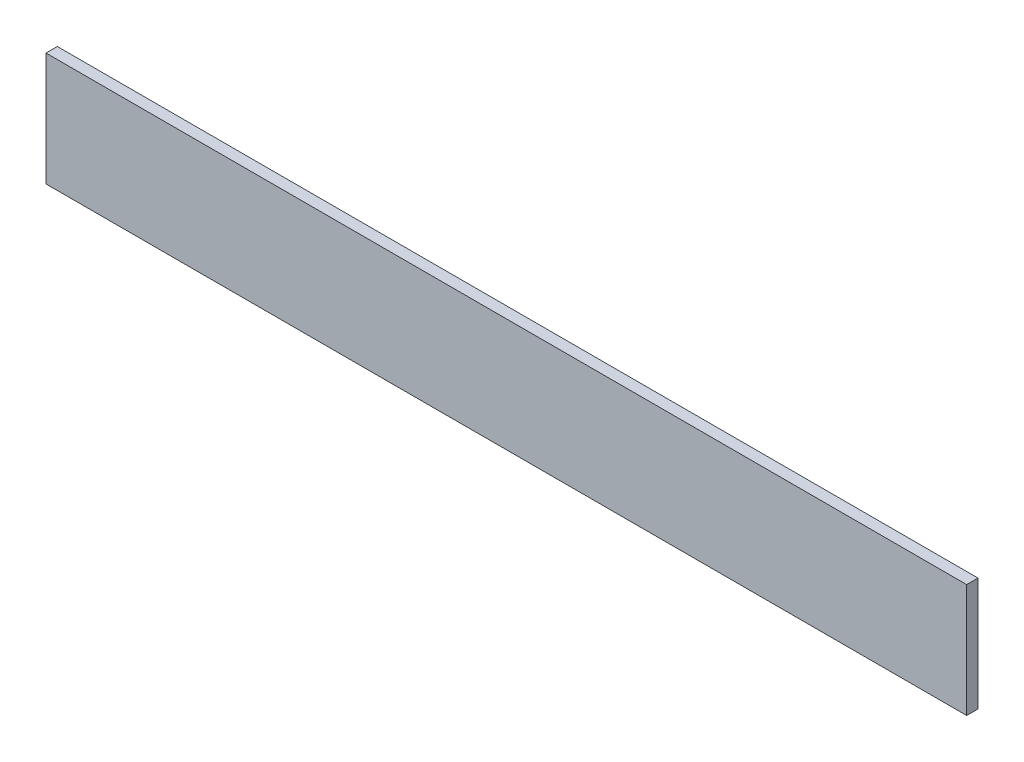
ISO-10303-21;
HEADER;
FILE_DESCRIPTION(('STEP AP214'),'2;1');
FILE_NAME('part.step','',(''),(''),'','','');
FILE_SCHEMA(('AUTOMOTIVE_DESIGN { 1 0 10303 214 1 1 1 1 }'));
ENDSEC;
DATA;
#1=APPLICATION_CONTEXT('core data for automotive mechanical design processes');
#2=APPLICATION_PROTOCOL_DEFINITION('international standard','automotive_design',2000,#1);
#3=PRODUCT_CONTEXT('',#1,'mechanical');
#4=PRODUCT('Part','Part','',(#3));
#5=PRODUCT_RELATED_PRODUCT_CATEGORY('part','',(#4));
#6=PRODUCT_DEFINITION_FORMATION('','',#4);
#7=PRODUCT_DEFINITION_CONTEXT('part definition',#1,'design');
#8=PRODUCT_DEFINITION('design','',#6,#7);
#9=PRODUCT_DEFINITION_SHAPE('','',#8);
#10=(LENGTH_UNIT() NAMED_UNIT(*) SI_UNIT(.MILLI.,.METRE.));
#11=(NAMED_UNIT(*) PLANE_ANGLE_UNIT() SI_UNIT($,.RADIAN.));
#12=(NAMED_UNIT(*) SI_UNIT($,.STERADIAN.) SOLID_ANGLE_UNIT());
#13=UNCERTAINTY_MEASURE_WITH_UNIT(LENGTH_MEASURE(1.E-05),#10,'distance_accuracy_value','');
#14=(GEOMETRIC_REPRESENTATION_CONTEXT(3) GLOBAL_UNCERTAINTY_ASSIGNED_CONTEXT((#13)) GLOBAL_UNIT_ASSIGNED_CONTEXT((#10,
#11,#12)) REPRESENTATION_CONTEXT('',''));
#15=CARTESIAN_POINT('',(0.,0.,0.));
#16=DIRECTION('',(0.,0.,1.));
#17=DIRECTION('',(1.,0.,0.));
#18=AXIS2_PLACEMENT_3D('',#15,#16,#17);
#19=CARTESIAN_POINT('',(0.,0.,10.));
#20=DIRECTION('',(1.,0.,0.));
#21=DIRECTION('',(0.,1.,0.));
#22=AXIS2_PLACEMENT_3D('',#19,#20,#21);
#23=PLANE('',#22);
#24=DIRECTION('',(0.,-1.,0.));
#25=VECTOR('',#24,1.);
#26=CARTESIAN_POINT('',(0.,0.,0.));
#27=LINE('',#26,#25);
#28=CARTESIAN_POINT('',(0.,0.,0.));
#29=VERTEX_POINT('',#28);
#30=CARTESIAN_POINT('',(0.,-100.,0.));
#31=VERTEX_POINT('',#30);
#32=EDGE_CURVE('E75',#29,#31,#27,.T.);
#33=ORIENTED_EDGE('',*,*,#32,.T.);
#34=DIRECTION('',(0.,0.,-1.));
#35=VECTOR('',#34,1.);
#36=CARTESIAN_POINT('',(0.,-100.,10.));
#37=LINE('',#36,#35);
#38=CARTESIAN_POINT('',(0.,-100.,10.));
#39=VERTEX_POINT('',#38);
#40=EDGE_CURVE('E11',#39,#31,#37,.T.);
#41=ORIENTED_EDGE('',*,*,#40,.F.);
#42=DIRECTION('',(0.,-1.,0.));
#43=VECTOR('',#42,1.);
#44=CARTESIAN_POINT('',(0.,0.,10.));
#45=LINE('',#44,#43);
#46=CARTESIAN_POINT('',(0.,0.,10.));
#47=VERTEX_POINT('',#46);
#48=EDGE_CURVE('E93',#47,#39,#45,.T.);
#49=ORIENTED_EDGE('',*,*,#48,.F.);
#50=DIRECTION('',(0.,0.,-1.));
#51=VECTOR('',#50,1.);
#52=CARTESIAN_POINT('',(0.,0.,10.));
#53=LINE('',#52,#51);
#54=EDGE_CURVE('E87',#47,#29,#53,.T.);
#55=ORIENTED_EDGE('',*,*,#54,.T.);
#56=EDGE_LOOP('',(#33,#41,#49,#55));
#57=FACE_BOUND('',#56,.T.);
#58=ADVANCED_FACE('F31',(#57),#23,.F.);
#59=CARTESIAN_POINT('',(0.,-100.,10.));
#60=DIRECTION('',(0.,1.,0.));
#61=DIRECTION('',(0.,0.,1.));
#62=AXIS2_PLACEMENT_3D('',#59,#60,#61);
#63=PLANE('',#62);
#64=DIRECTION('',(1.,0.,0.));
#65=VECTOR('',#64,1.);
#66=CARTESIAN_POINT('',(0.,-100.,0.));
#67=LINE('',#66,#65);
#68=CARTESIAN_POINT('',(812.,-100.,0.));
#69=VERTEX_POINT('',#68);
#70=EDGE_CURVE('E71',#31,#69,#67,.T.);
#71=ORIENTED_EDGE('',*,*,#70,.T.);
#72=DIRECTION('',(0.,0.,-1.));
#73=VECTOR('',#72,1.);
#74=CARTESIAN_POINT('',(812.,-100.,10.));
#75=LINE('',#74,#73);
#76=CARTESIAN_POINT('',(812.,-100.,10.));
#77=VERTEX_POINT('',#76);
#78=EDGE_CURVE('E38',#77,#69,#75,.T.);
#79=ORIENTED_EDGE('',*,*,#78,.F.);
#80=DIRECTION('',(1.,0.,0.));
#81=VECTOR('',#80,1.);
#82=CARTESIAN_POINT('',(0.,-100.,10.));
#83=LINE('',#82,#81);
#84=EDGE_CURVE('E83',#39,#77,#83,.T.);
#85=ORIENTED_EDGE('',*,*,#84,.F.);
#86=ORIENTED_EDGE('',*,*,#40,.T.);
#87=EDGE_LOOP('',(#71,#79,#85,#86));
#88=FACE_BOUND('',#87,.T.);
#89=ADVANCED_FACE('F82',(#88),#63,.F.);
#90=CARTESIAN_POINT('',(812.,0.,10.));
#91=DIRECTION('',(-1.,0.,0.));
#92=DIRECTION('',(0.,0.,1.));
#93=AXIS2_PLACEMENT_3D('',#90,#91,#92);
#94=PLANE('',#93);
#95=DIRECTION('',(0.,1.,0.));
#96=VECTOR('',#95,1.);
#97=CARTESIAN_POINT('',(812.,0.,0.));
#98=LINE('',#97,#96);
#99=CARTESIAN_POINT('',(812.,0.,0.));
#100=VERTEX_POINT('',#99);
#101=EDGE_CURVE('E76',#69,#100,#98,.T.);
#102=ORIENTED_EDGE('',*,*,#101,.T.);
#103=DIRECTION('',(0.,0.,-1.));
#104=VECTOR('',#103,1.);
#105=CARTESIAN_POINT('',(812.,0.,10.));
#106=LINE('',#105,#104);
#107=CARTESIAN_POINT('',(812.,0.,10.));
#108=VERTEX_POINT('',#107);
#109=EDGE_CURVE('E99',#108,#100,#106,.T.);
#110=ORIENTED_EDGE('',*,*,#109,.F.);
#111=DIRECTION('',(0.,1.,0.));
#112=VECTOR('',#111,1.);
#113=CARTESIAN_POINT('',(812.,0.,10.));
#114=LINE('',#113,#112);
#115=EDGE_CURVE('E50',#77,#108,#114,.T.);
#116=ORIENTED_EDGE('',*,*,#115,.F.);
#117=ORIENTED_EDGE('',*,*,#78,.T.);
#118=EDGE_LOOP('',(#102,#110,#116,#117));
#119=FACE_BOUND('',#118,.T.);
#120=ADVANCED_FACE('F102',(#119),#94,.F.);
#121=CARTESIAN_POINT('',(0.,0.,10.));
#122=DIRECTION('',(0.,-1.,0.));
#123=DIRECTION('',(0.,0.,-1.));
#124=AXIS2_PLACEMENT_3D('',#121,#122,#123);
#125=PLANE('',#124);
#126=DIRECTION('',(-1.,0.,0.));
#127=VECTOR('',#126,1.);
#128=CARTESIAN_POINT('',(0.,0.,0.));
#129=LINE('',#128,#127);
#130=EDGE_CURVE('E91',#100,#29,#129,.T.);
#131=ORIENTED_EDGE('',*,*,#130,.T.);
#132=ORIENTED_EDGE('',*,*,#54,.F.);
#133=DIRECTION('',(-1.,0.,0.));
#134=VECTOR('',#133,1.);
#135=CARTESIAN_POINT('',(0.,0.,10.));
#136=LINE('',#135,#134);
#137=EDGE_CURVE('E45',#108,#47,#136,.T.);
#138=ORIENTED_EDGE('',*,*,#137,.F.);
#139=ORIENTED_EDGE('',*,*,#109,.T.);
#140=EDGE_LOOP('',(#131,#132,#138,#139));
#141=FACE_BOUND('',#140,.T.);
#142=ADVANCED_FACE('F104',(#141),#125,.F.);
#143=CARTESIAN_POINT('',(0.,-100.,10.));
#144=DIRECTION('',(0.,0.,1.));
#145=DIRECTION('',(1.,0.,0.));
#146=AXIS2_PLACEMENT_3D('',#143,#144,#145);
#147=PLANE('',#146);
#148=ORIENTED_EDGE('',*,*,#48,.T.);
#149=ORIENTED_EDGE('',*,*,#84,.T.);
#150=ORIENTED_EDGE('',*,*,#115,.T.);
#151=ORIENTED_EDGE('',*,*,#137,.T.);
#152=EDGE_LOOP('',(#148,#149,#150,#151));
#153=FACE_BOUND('',#152,.T.);
#154=ADVANCED_FACE('F105',(#153),#147,.T.);
#155=CARTESIAN_POINT('',(0.,-100.,0.));
#156=DIRECTION('',(0.,0.,1.));
#157=DIRECTION('',(1.,0.,0.));
#158=AXIS2_PLACEMENT_3D('',#155,#156,#157);
#159=PLANE('',#158);
#160=ORIENTED_EDGE('',*,*,#32,.F.);
#161=ORIENTED_EDGE('',*,*,#130,.F.);
#162=ORIENTED_EDGE('',*,*,#101,.F.);
#163=ORIENTED_EDGE('',*,*,#70,.F.);
#164=EDGE_LOOP('',(#160,#161,#162,#163));
#165=FACE_BOUND('',#164,.T.);
#166=ADVANCED_FACE('F72',(#165),#159,.F.);
#167=CLOSED_SHELL('',(#58,#89,#120,#142,#154,#166));
#168=MANIFOLD_SOLID_BREP('B2',#167);
#169=ADVANCED_BREP_SHAPE_REPRESENTATION('',(#18,#168),#14);
#170=SHAPE_DEFINITION_REPRESENTATION(#9,#169);
ENDSEC;
END-ISO-10303-21;
